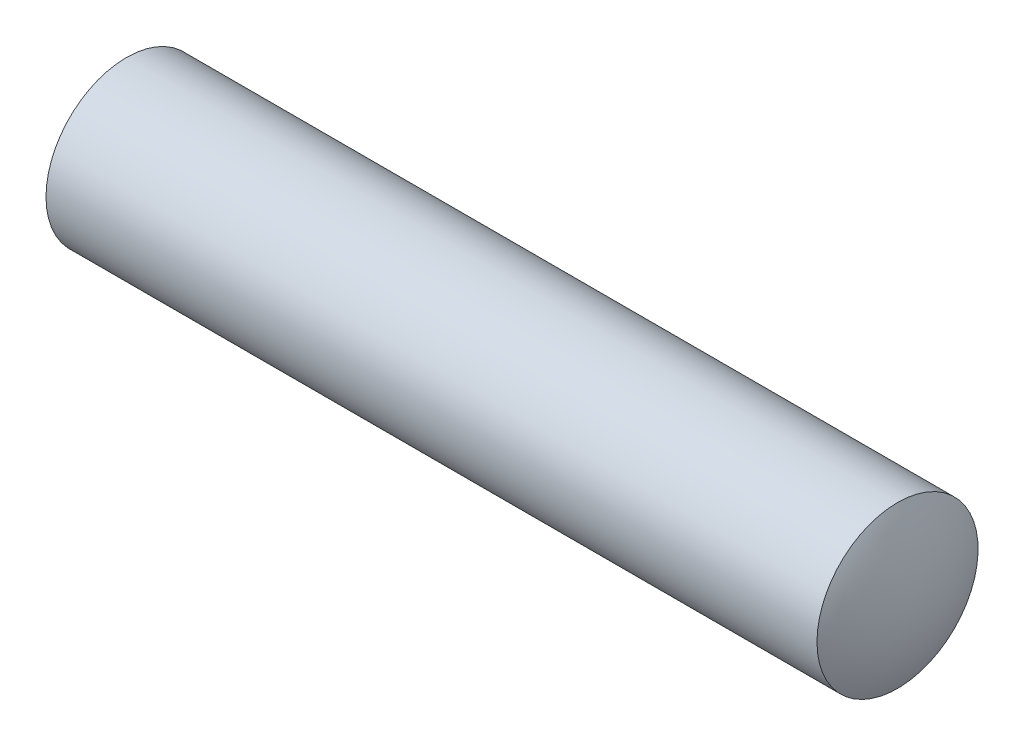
from build123d import *


with BuildPart() as part:
    # Esquisse1 → Base-R_volution (revolve)
    with BuildSketch(Plane.XY):
        with BuildLine():
            Line((9.5, 1.985), (-9.5, 1.985))
            ThreePointArc((-9.5, 1.985), (-9.873077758, 1.023501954), (-10, 0))
            Line((-10, 0), (10, 0))
            ThreePointArc((10, 0), (9.873077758, 1.023501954), (9.5, 1.985))
        make_face()
    revolve(axis=Axis((-10, 0, 0), (1, 0, 0)))


solid = part.part
